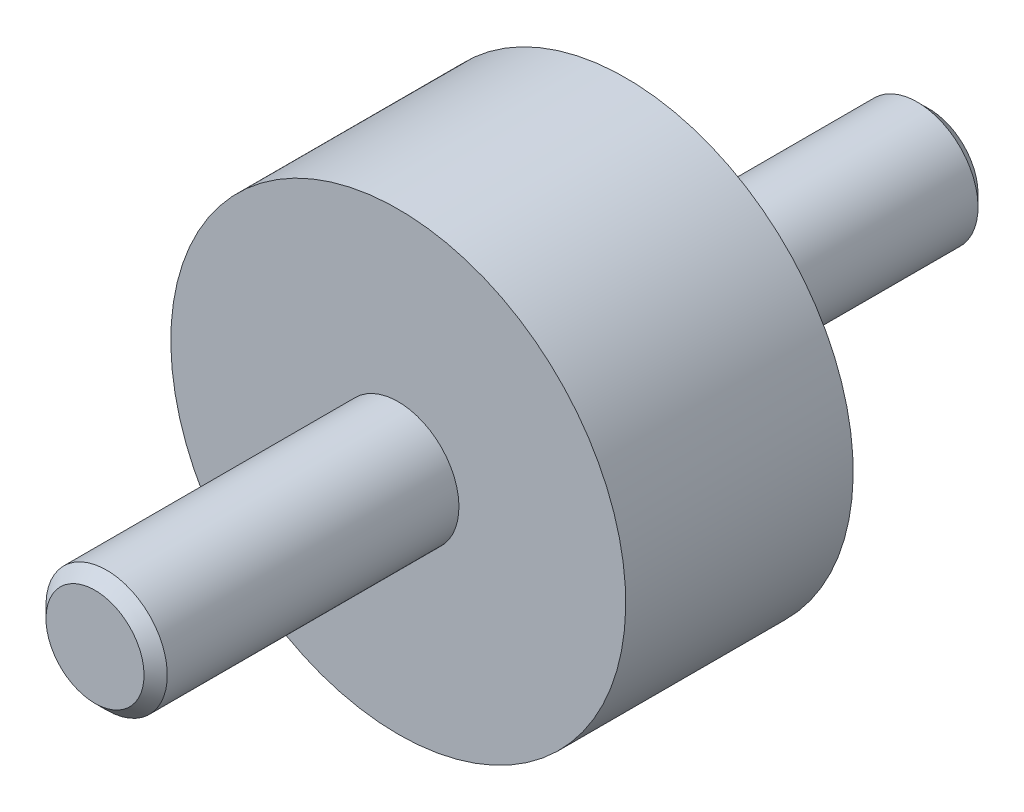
ISO-10303-21;
HEADER;
FILE_DESCRIPTION(('STEP AP214'),'2;1');
FILE_NAME('part.step','',(''),(''),'','','');
FILE_SCHEMA(('AUTOMOTIVE_DESIGN { 1 0 10303 214 1 1 1 1 }'));
ENDSEC;
DATA;
#1=APPLICATION_CONTEXT('core data for automotive mechanical design processes');
#2=APPLICATION_PROTOCOL_DEFINITION('international standard','automotive_design',2000,#1);
#3=PRODUCT_CONTEXT('',#1,'mechanical');
#4=PRODUCT('Part','Part','',(#3));
#5=PRODUCT_RELATED_PRODUCT_CATEGORY('part','',(#4));
#6=PRODUCT_DEFINITION_FORMATION('','',#4);
#7=PRODUCT_DEFINITION_CONTEXT('part definition',#1,'design');
#8=PRODUCT_DEFINITION('design','',#6,#7);
#9=PRODUCT_DEFINITION_SHAPE('','',#8);
#10=(LENGTH_UNIT() NAMED_UNIT(*) SI_UNIT(.MILLI.,.METRE.));
#11=(NAMED_UNIT(*) PLANE_ANGLE_UNIT() SI_UNIT($,.RADIAN.));
#12=(NAMED_UNIT(*) SI_UNIT($,.STERADIAN.) SOLID_ANGLE_UNIT());
#13=UNCERTAINTY_MEASURE_WITH_UNIT(LENGTH_MEASURE(1.E-05),#10,'distance_accuracy_value','');
#14=(GEOMETRIC_REPRESENTATION_CONTEXT(3) GLOBAL_UNCERTAINTY_ASSIGNED_CONTEXT((#13)) GLOBAL_UNIT_ASSIGNED_CONTEXT((#10,
#11,#12)) REPRESENTATION_CONTEXT('',''));
#15=CARTESIAN_POINT('',(0.,0.,0.));
#16=DIRECTION('',(0.,0.,1.));
#17=DIRECTION('',(1.,0.,0.));
#18=AXIS2_PLACEMENT_3D('',#15,#16,#17);
#19=CARTESIAN_POINT('',(14.,0.,15.));
#20=DIRECTION('',(0.,0.,1.));
#21=DIRECTION('',(0.,-1.,0.));
#22=AXIS2_PLACEMENT_3D('',#19,#20,#21);
#23=PLANE('',#22);
#24=CARTESIAN_POINT('',(0.,0.,15.));
#25=DIRECTION('',(0.,0.,1.));
#26=DIRECTION('',(0.,-1.,0.));
#27=AXIS2_PLACEMENT_3D('',#24,#25,#26);
#28=CIRCLE('',#27,4.);
#29=CARTESIAN_POINT('',(0.,-4.,15.));
#30=VERTEX_POINT('',#29);
#31=EDGE_CURVE('E8',#30,#30,#28,.T.);
#32=ORIENTED_EDGE('',*,*,#31,.F.);
#33=EDGE_LOOP('',(#32));
#34=FACE_BOUND('',#33,.T.);
#35=CARTESIAN_POINT('',(0.,0.,15.));
#36=DIRECTION('',(0.,0.,1.));
#37=DIRECTION('',(0.,-1.,0.));
#38=AXIS2_PLACEMENT_3D('',#35,#36,#37);
#39=CIRCLE('',#38,15.);
#40=CARTESIAN_POINT('',(0.,-15.,15.));
#41=VERTEX_POINT('',#40);
#42=EDGE_CURVE('E22',#41,#41,#39,.T.);
#43=ORIENTED_EDGE('',*,*,#42,.T.);
#44=EDGE_LOOP('',(#43));
#45=FACE_BOUND('',#44,.T.);
#46=ADVANCED_FACE('F12',(#34,#45),#23,.T.);
#47=CARTESIAN_POINT('',(0.,0.,0.5));
#48=DIRECTION('',(0.,0.,1.));
#49=DIRECTION('',(0.,-1.,0.));
#50=AXIS2_PLACEMENT_3D('',#47,#48,#49);
#51=CYLINDRICAL_SURFACE('',#50,15.);
#52=CARTESIAN_POINT('',(0.,0.,0.));
#53=DIRECTION('',(0.,0.,1.));
#54=DIRECTION('',(0.,-1.,0.));
#55=AXIS2_PLACEMENT_3D('',#52,#53,#54);
#56=CIRCLE('',#55,15.);
#57=CARTESIAN_POINT('',(0.,-15.,0.));
#58=VERTEX_POINT('',#57);
#59=EDGE_CURVE('E26',#58,#58,#56,.T.);
#60=ORIENTED_EDGE('',*,*,#59,.T.);
#61=EDGE_LOOP('',(#60));
#62=FACE_BOUND('',#61,.T.);
#63=ORIENTED_EDGE('',*,*,#42,.F.);
#64=EDGE_LOOP('',(#63));
#65=FACE_BOUND('',#64,.T.);
#66=ADVANCED_FACE('F57',(#62,#65),#51,.T.);
#67=CARTESIAN_POINT('',(15.,0.,0.));
#68=DIRECTION('',(0.,0.,-1.));
#69=DIRECTION('',(0.,1.,0.));
#70=AXIS2_PLACEMENT_3D('',#67,#68,#69);
#71=PLANE('',#70);
#72=CARTESIAN_POINT('',(0.,0.,0.));
#73=DIRECTION('',(0.,0.,-1.));
#74=DIRECTION('',(0.,1.,0.));
#75=AXIS2_PLACEMENT_3D('',#72,#73,#74);
#76=CIRCLE('',#75,4.);
#77=CARTESIAN_POINT('',(0.,4.,0.));
#78=VERTEX_POINT('',#77);
#79=EDGE_CURVE('E18',#78,#78,#76,.T.);
#80=ORIENTED_EDGE('',*,*,#79,.F.);
#81=EDGE_LOOP('',(#80));
#82=FACE_BOUND('',#81,.T.);
#83=ORIENTED_EDGE('',*,*,#59,.F.);
#84=EDGE_LOOP('',(#83));
#85=FACE_BOUND('',#84,.T.);
#86=ADVANCED_FACE('F62',(#82,#85),#71,.T.);
#87=CARTESIAN_POINT('',(0.,0.,-20.));
#88=DIRECTION('',(0.,0.,1.));
#89=DIRECTION('',(0.,-1.,0.));
#90=AXIS2_PLACEMENT_3D('',#87,#88,#89);
#91=CYLINDRICAL_SURFACE('',#90,4.);
#92=CARTESIAN_POINT('',(0.,0.,-19.233));
#93=DIRECTION('',(0.,0.,1.));
#94=DIRECTION('',(0.,-1.,0.));
#95=AXIS2_PLACEMENT_3D('',#92,#93,#94);
#96=CIRCLE('',#95,4.);
#97=CARTESIAN_POINT('',(0.,-4.,-19.233));
#98=VERTEX_POINT('',#97);
#99=EDGE_CURVE('E31',#98,#98,#96,.T.);
#100=ORIENTED_EDGE('',*,*,#99,.T.);
#101=EDGE_LOOP('',(#100));
#102=FACE_BOUND('',#101,.T.);
#103=ORIENTED_EDGE('',*,*,#79,.T.);
#104=EDGE_LOOP('',(#103));
#105=FACE_BOUND('',#104,.T.);
#106=ADVANCED_FACE('F70',(#102,#105),#91,.T.);
#107=CARTESIAN_POINT('',(0.,0.,-19.233));
#108=DIRECTION('',(0.,0.,1.));
#109=DIRECTION('',(0.,-1.,0.));
#110=AXIS2_PLACEMENT_3D('',#107,#108,#109);
#111=CONICAL_SURFACE('',#110,4.,0.785398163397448);
#112=CARTESIAN_POINT('',(0.,0.,-20.));
#113=DIRECTION('',(0.,0.,1.));
#114=DIRECTION('',(0.,-1.,0.));
#115=AXIS2_PLACEMENT_3D('',#112,#113,#114);
#116=CIRCLE('',#115,3.233);
#117=CARTESIAN_POINT('',(0.,-3.233,-20.));
#118=VERTEX_POINT('',#117);
#119=EDGE_CURVE('E34',#118,#118,#116,.T.);
#120=ORIENTED_EDGE('',*,*,#119,.T.);
#121=EDGE_LOOP('',(#120));
#122=FACE_BOUND('',#121,.T.);
#123=ORIENTED_EDGE('',*,*,#99,.F.);
#124=EDGE_LOOP('',(#123));
#125=FACE_BOUND('',#124,.T.);
#126=ADVANCED_FACE('F76',(#122,#125),#111,.T.);
#127=CARTESIAN_POINT('',(3.233,0.,-20.));
#128=DIRECTION('',(0.,0.,-1.));
#129=DIRECTION('',(0.,1.,0.));
#130=AXIS2_PLACEMENT_3D('',#127,#128,#129);
#131=PLANE('',#130);
#132=ORIENTED_EDGE('',*,*,#119,.F.);
#133=EDGE_LOOP('',(#132));
#134=FACE_BOUND('',#133,.T.);
#135=ADVANCED_FACE('F80',(#134),#131,.T.);
#136=CARTESIAN_POINT('',(0.,0.,35.));
#137=DIRECTION('',(0.,0.,1.));
#138=DIRECTION('',(0.,-1.,0.));
#139=AXIS2_PLACEMENT_3D('',#136,#137,#138);
#140=PLANE('',#139);
#141=CARTESIAN_POINT('',(0.,0.,35.));
#142=DIRECTION('',(0.,0.,1.));
#143=DIRECTION('',(0.,-1.,0.));
#144=AXIS2_PLACEMENT_3D('',#141,#142,#143);
#145=CIRCLE('',#144,3.233);
#146=CARTESIAN_POINT('',(0.,-3.233,35.));
#147=VERTEX_POINT('',#146);
#148=EDGE_CURVE('E37',#147,#147,#145,.T.);
#149=ORIENTED_EDGE('',*,*,#148,.T.);
#150=EDGE_LOOP('',(#149));
#151=FACE_BOUND('',#150,.T.);
#152=ADVANCED_FACE('F54',(#151),#140,.T.);
#153=CARTESIAN_POINT('',(0.,0.,35.));
#154=DIRECTION('',(0.,0.,-1.));
#155=DIRECTION('',(0.,1.,0.));
#156=AXIS2_PLACEMENT_3D('',#153,#154,#155);
#157=CONICAL_SURFACE('',#156,3.233,0.785398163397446);
#158=CARTESIAN_POINT('',(0.,0.,34.233));
#159=DIRECTION('',(0.,0.,1.));
#160=DIRECTION('',(0.,-1.,0.));
#161=AXIS2_PLACEMENT_3D('',#158,#159,#160);
#162=CIRCLE('',#161,4.);
#163=CARTESIAN_POINT('',(0.,-4.,34.233));
#164=VERTEX_POINT('',#163);
#165=EDGE_CURVE('E40',#164,#164,#162,.T.);
#166=ORIENTED_EDGE('',*,*,#165,.T.);
#167=EDGE_LOOP('',(#166));
#168=FACE_BOUND('',#167,.T.);
#169=ORIENTED_EDGE('',*,*,#148,.F.);
#170=EDGE_LOOP('',(#169));
#171=FACE_BOUND('',#170,.T.);
#172=ADVANCED_FACE('F44',(#168,#171),#157,.T.);
#173=CARTESIAN_POINT('',(0.,0.,15.));
#174=DIRECTION('',(0.,0.,1.));
#175=DIRECTION('',(0.,-1.,0.));
#176=AXIS2_PLACEMENT_3D('',#173,#174,#175);
#177=CYLINDRICAL_SURFACE('',#176,4.);
#178=ORIENTED_EDGE('',*,*,#31,.T.);
#179=EDGE_LOOP('',(#178));
#180=FACE_BOUND('',#179,.T.);
#181=ORIENTED_EDGE('',*,*,#165,.F.);
#182=EDGE_LOOP('',(#181));
#183=FACE_BOUND('',#182,.T.);
#184=ADVANCED_FACE('F47',(#180,#183),#177,.T.);
#185=CLOSED_SHELL('',(#46,#66,#86,#106,#126,#135,#152,#172,#184));
#186=MANIFOLD_SOLID_BREP('B1',#185);
#187=ADVANCED_BREP_SHAPE_REPRESENTATION('',(#18,#186),#14);
#188=SHAPE_DEFINITION_REPRESENTATION(#9,#187);
ENDSEC;
END-ISO-10303-21;
